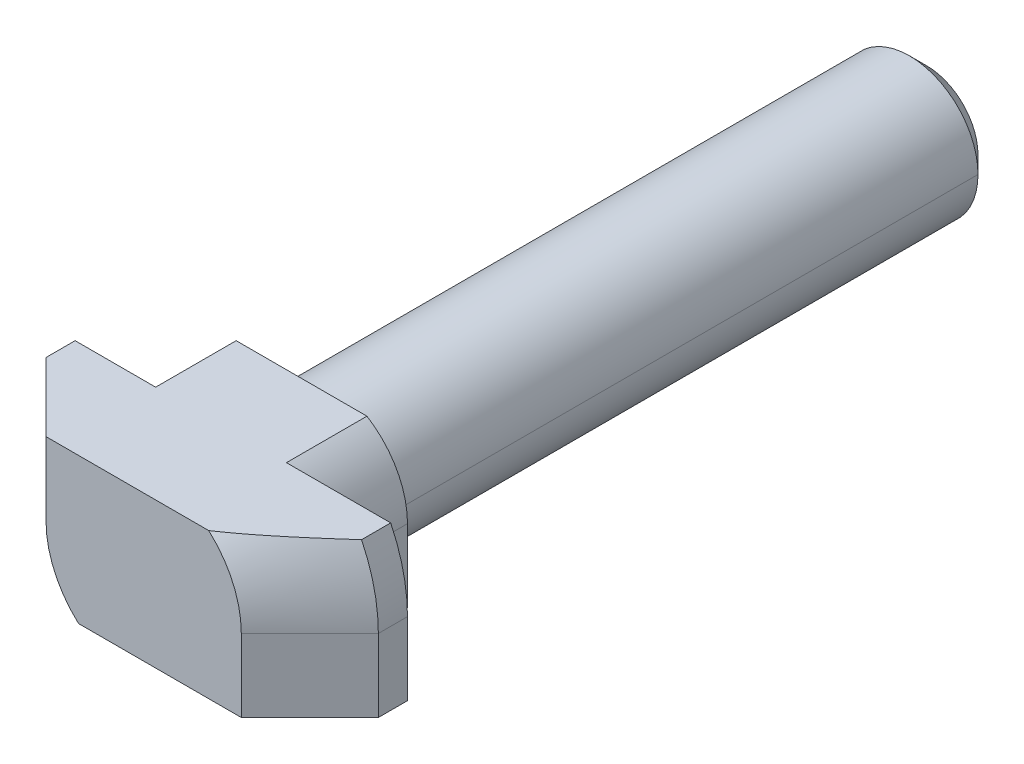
ISO-10303-21;
HEADER;
FILE_DESCRIPTION(('STEP AP214'),'2;1');
FILE_NAME('part.step','',(''),(''),'','','');
FILE_SCHEMA(('AUTOMOTIVE_DESIGN { 1 0 10303 214 1 1 1 1 }'));
ENDSEC;
DATA;
#1=APPLICATION_CONTEXT('core data for automotive mechanical design processes');
#2=APPLICATION_PROTOCOL_DEFINITION('international standard','automotive_design',2000,#1);
#3=PRODUCT_CONTEXT('',#1,'mechanical');
#4=PRODUCT('Part','Part','',(#3));
#5=PRODUCT_RELATED_PRODUCT_CATEGORY('part','',(#4));
#6=PRODUCT_DEFINITION_FORMATION('','',#4);
#7=PRODUCT_DEFINITION_CONTEXT('part definition',#1,'design');
#8=PRODUCT_DEFINITION('design','',#6,#7);
#9=PRODUCT_DEFINITION_SHAPE('','',#8);
#10=(LENGTH_UNIT() NAMED_UNIT(*) SI_UNIT(.MILLI.,.METRE.));
#11=(NAMED_UNIT(*) PLANE_ANGLE_UNIT() SI_UNIT($,.RADIAN.));
#12=(NAMED_UNIT(*) SI_UNIT($,.STERADIAN.) SOLID_ANGLE_UNIT());
#13=UNCERTAINTY_MEASURE_WITH_UNIT(LENGTH_MEASURE(1.E-05),#10,'distance_accuracy_value','');
#14=(GEOMETRIC_REPRESENTATION_CONTEXT(3) GLOBAL_UNCERTAINTY_ASSIGNED_CONTEXT((#13)) GLOBAL_UNIT_ASSIGNED_CONTEXT((#10,
#11,#12)) REPRESENTATION_CONTEXT('',''));
#15=CARTESIAN_POINT('',(0.,0.,0.));
#16=DIRECTION('',(0.,0.,1.));
#17=DIRECTION('',(1.,0.,0.));
#18=AXIS2_PLACEMENT_3D('',#15,#16,#17);
#19=CARTESIAN_POINT('',(0.,0.,-3.5));
#20=DIRECTION('',(0.,0.,-1.));
#21=DIRECTION('',(1.,0.,0.));
#22=AXIS2_PLACEMENT_3D('',#19,#20,#21);
#23=CYLINDRICAL_SURFACE('',#22,4.);
#24=CARTESIAN_POINT('',(0.,0.,-4.7));
#25=DIRECTION('',(0.,0.,1.));
#26=DIRECTION('',(-1.,0.,0.));
#27=AXIS2_PLACEMENT_3D('',#24,#25,#26);
#28=CIRCLE('',#27,4.);
#29=CARTESIAN_POINT('',(-4.,0.,-4.7));
#30=VERTEX_POINT('',#29);
#31=CARTESIAN_POINT('',(4.,0.,-4.7));
#32=VERTEX_POINT('',#31);
#33=EDGE_CURVE('E124',#30,#32,#28,.T.);
#34=ORIENTED_EDGE('',*,*,#33,.F.);
#35=DIRECTION('',(0.,0.,-1.));
#36=VECTOR('',#35,1.);
#37=CARTESIAN_POINT('',(-4.,0.,-4.7));
#38=LINE('',#37,#36);
#39=CARTESIAN_POINT('',(-4.,0.,-39.));
#40=VERTEX_POINT('',#39);
#41=EDGE_CURVE('E10',#30,#40,#38,.T.);
#42=ORIENTED_EDGE('',*,*,#41,.T.);
#43=CARTESIAN_POINT('',(0.,0.,-39.));
#44=DIRECTION('',(0.,0.,-1.));
#45=DIRECTION('',(1.,0.,0.));
#46=AXIS2_PLACEMENT_3D('',#43,#44,#45);
#47=CIRCLE('',#46,4.);
#48=CARTESIAN_POINT('',(4.,0.,-39.));
#49=VERTEX_POINT('',#48);
#50=EDGE_CURVE('E120',#49,#40,#47,.T.);
#51=ORIENTED_EDGE('',*,*,#50,.F.);
#52=DIRECTION('',(0.,0.,1.));
#53=VECTOR('',#52,1.);
#54=CARTESIAN_POINT('',(4.,0.,-39.));
#55=LINE('',#54,#53);
#56=EDGE_CURVE('E25',#49,#32,#55,.T.);
#57=ORIENTED_EDGE('',*,*,#56,.T.);
#58=EDGE_LOOP('',(#34,#42,#51,#57));
#59=FACE_BOUND('',#58,.T.);
#60=ADVANCED_FACE('F15',(#59),#23,.T.);
#61=CARTESIAN_POINT('',(0.,0.,-3.5));
#62=DIRECTION('',(0.,0.,-1.));
#63=DIRECTION('',(1.,0.,0.));
#64=AXIS2_PLACEMENT_3D('',#61,#62,#63);
#65=CYLINDRICAL_SURFACE('',#64,4.);
#66=CARTESIAN_POINT('',(0.,0.,-4.7));
#67=DIRECTION('',(0.,0.,1.));
#68=DIRECTION('',(1.,0.,0.));
#69=AXIS2_PLACEMENT_3D('',#66,#67,#68);
#70=CIRCLE('',#69,4.);
#71=EDGE_CURVE('E132',#32,#30,#70,.T.);
#72=ORIENTED_EDGE('',*,*,#71,.F.);
#73=ORIENTED_EDGE('',*,*,#56,.F.);
#74=CARTESIAN_POINT('',(0.,0.,-39.));
#75=DIRECTION('',(0.,0.,-1.));
#76=DIRECTION('',(-1.,0.,0.));
#77=AXIS2_PLACEMENT_3D('',#74,#75,#76);
#78=CIRCLE('',#77,4.);
#79=EDGE_CURVE('E109',#40,#49,#78,.T.);
#80=ORIENTED_EDGE('',*,*,#79,.F.);
#81=ORIENTED_EDGE('',*,*,#41,.F.);
#82=EDGE_LOOP('',(#72,#73,#80,#81));
#83=FACE_BOUND('',#82,.T.);
#84=ADVANCED_FACE('F708',(#83),#65,.T.);
#85=CARTESIAN_POINT('',(0.,0.,-39.5));
#86=DIRECTION('',(0.,0.,1.));
#87=DIRECTION('',(-1.,0.,0.));
#88=AXIS2_PLACEMENT_3D('',#85,#86,#87);
#89=CONICAL_SURFACE('',#88,3.5,0.785398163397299);
#90=ORIENTED_EDGE('',*,*,#79,.T.);
#91=DIRECTION('',(0.707106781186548,0.,0.707106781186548));
#92=VECTOR('',#91,1.);
#93=CARTESIAN_POINT('',(3.,0.,-40.));
#94=LINE('',#93,#92);
#95=CARTESIAN_POINT('',(3.,0.,-40.));
#96=VERTEX_POINT('',#95);
#97=EDGE_CURVE('E103',#96,#49,#94,.T.);
#98=ORIENTED_EDGE('',*,*,#97,.F.);
#99=CARTESIAN_POINT('',(0.,0.,-40.));
#100=DIRECTION('',(0.,0.,-1.));
#101=DIRECTION('',(-1.,0.,0.));
#102=AXIS2_PLACEMENT_3D('',#99,#100,#101);
#103=CIRCLE('',#102,3.);
#104=CARTESIAN_POINT('',(-3.,0.,-40.));
#105=VERTEX_POINT('',#104);
#106=EDGE_CURVE('E108',#105,#96,#103,.T.);
#107=ORIENTED_EDGE('',*,*,#106,.F.);
#108=DIRECTION('',(0.707106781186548,0.,-0.707106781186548));
#109=VECTOR('',#108,1.);
#110=CARTESIAN_POINT('',(-4.,0.,-39.));
#111=LINE('',#110,#109);
#112=EDGE_CURVE('E113',#40,#105,#111,.T.);
#113=ORIENTED_EDGE('',*,*,#112,.F.);
#114=EDGE_LOOP('',(#90,#98,#107,#113));
#115=FACE_BOUND('',#114,.T.);
#116=ADVANCED_FACE('F105',(#115),#89,.T.);
#117=CARTESIAN_POINT('',(0.,0.,-39.5));
#118=DIRECTION('',(0.,0.,1.));
#119=DIRECTION('',(-1.,0.,0.));
#120=AXIS2_PLACEMENT_3D('',#117,#118,#119);
#121=CONICAL_SURFACE('',#120,3.5,0.785398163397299);
#122=ORIENTED_EDGE('',*,*,#50,.T.);
#123=ORIENTED_EDGE('',*,*,#112,.T.);
#124=CARTESIAN_POINT('',(0.,0.,-40.));
#125=DIRECTION('',(0.,0.,-1.));
#126=DIRECTION('',(1.,0.,0.));
#127=AXIS2_PLACEMENT_3D('',#124,#125,#126);
#128=CIRCLE('',#127,3.);
#129=EDGE_CURVE('E116',#96,#105,#128,.T.);
#130=ORIENTED_EDGE('',*,*,#129,.F.);
#131=ORIENTED_EDGE('',*,*,#97,.T.);
#132=EDGE_LOOP('',(#122,#123,#130,#131));
#133=FACE_BOUND('',#132,.T.);
#134=ADVANCED_FACE('F117',(#133),#121,.T.);
#135=CARTESIAN_POINT('',(0.,0.,-40.));
#136=DIRECTION('',(0.,0.,1.));
#137=DIRECTION('',(1.,0.,0.));
#138=AXIS2_PLACEMENT_3D('',#135,#136,#137);
#139=PLANE('',#138);
#140=ORIENTED_EDGE('',*,*,#106,.T.);
#141=ORIENTED_EDGE('',*,*,#129,.T.);
#142=EDGE_LOOP('',(#140,#141));
#143=FACE_BOUND('',#142,.T.);
#144=ADVANCED_FACE('F122',(#143),#139,.F.);
#145=CARTESIAN_POINT('',(-4.25,-4.25,-4.7));
#146=DIRECTION('',(0.,0.,-1.));
#147=DIRECTION('',(0.,-1.,0.));
#148=AXIS2_PLACEMENT_3D('',#145,#146,#147);
#149=PLANE('',#148);
#150=ORIENTED_EDGE('',*,*,#71,.T.);
#151=ORIENTED_EDGE('',*,*,#33,.T.);
#152=EDGE_LOOP('',(#150,#151));
#153=FACE_BOUND('',#152,.T.);
#154=DIRECTION('',(1.,0.,0.));
#155=VECTOR('',#154,1.);
#156=CARTESIAN_POINT('',(-5.,4.25,-4.7));
#157=LINE('',#156,#155);
#158=CARTESIAN_POINT('',(-5.,4.25,-4.7));
#159=VERTEX_POINT('',#158);
#160=CARTESIAN_POINT('',(2.633913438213,4.25,-4.7));
#161=VERTEX_POINT('',#160);
#162=EDGE_CURVE('E153',#159,#161,#157,.T.);
#163=ORIENTED_EDGE('',*,*,#162,.T.);
#164=CARTESIAN_POINT('',(0.,0.,-4.7));
#165=DIRECTION('',(0.,0.,-1.));
#166=DIRECTION('',(0.52678268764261,0.850000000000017,0.));
#167=AXIS2_PLACEMENT_3D('',#164,#165,#166);
#168=CIRCLE('',#167,5.);
#169=CARTESIAN_POINT('',(5.,0.,-4.7));
#170=VERTEX_POINT('',#169);
#171=EDGE_CURVE('E145',#161,#170,#168,.T.);
#172=ORIENTED_EDGE('',*,*,#171,.T.);
#173=DIRECTION('',(0.,-1.,0.));
#174=VECTOR('',#173,1.);
#175=CARTESIAN_POINT('',(5.,0.,-4.7));
#176=LINE('',#175,#174);
#177=CARTESIAN_POINT('',(5.,-4.25,-4.7));
#178=VERTEX_POINT('',#177);
#179=EDGE_CURVE('E398',#170,#178,#176,.T.);
#180=ORIENTED_EDGE('',*,*,#179,.T.);
#181=DIRECTION('',(-1.,0.,0.));
#182=VECTOR('',#181,1.);
#183=CARTESIAN_POINT('',(5.,-4.25,-4.7));
#184=LINE('',#183,#182);
#185=CARTESIAN_POINT('',(-2.633913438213,-4.25,-4.7));
#186=VERTEX_POINT('',#185);
#187=EDGE_CURVE('E369',#178,#186,#184,.T.);
#188=ORIENTED_EDGE('',*,*,#187,.T.);
#189=CARTESIAN_POINT('',(0.,0.,-4.7));
#190=DIRECTION('',(0.,0.,-1.));
#191=DIRECTION('',(-0.52678268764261,-0.850000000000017,0.));
#192=AXIS2_PLACEMENT_3D('',#189,#190,#191);
#193=CIRCLE('',#192,5.);
#194=CARTESIAN_POINT('',(-5.,0.,-4.7));
#195=VERTEX_POINT('',#194);
#196=EDGE_CURVE('E395',#186,#195,#193,.T.);
#197=ORIENTED_EDGE('',*,*,#196,.T.);
#198=DIRECTION('',(0.,1.,0.));
#199=VECTOR('',#198,1.);
#200=CARTESIAN_POINT('',(-5.,0.,-4.7));
#201=LINE('',#200,#199);
#202=EDGE_CURVE('E156',#195,#159,#201,.T.);
#203=ORIENTED_EDGE('',*,*,#202,.T.);
#204=EDGE_LOOP('',(#163,#172,#180,#188,#197,#203));
#205=FACE_BOUND('',#204,.T.);
#206=ADVANCED_FACE('F392',(#153,#205),#149,.T.);
#207=CARTESIAN_POINT('',(-5.,-4.25,-3.5));
#208=DIRECTION('',(-1.,0.,0.));
#209=DIRECTION('',(0.,0.,1.));
#210=AXIS2_PLACEMENT_3D('',#207,#208,#209);
#211=PLANE('',#210);
#212=ORIENTED_EDGE('',*,*,#202,.F.);
#213=DIRECTION('',(0.,0.,-1.));
#214=VECTOR('',#213,1.);
#215=CARTESIAN_POINT('',(-5.,0.,0.));
#216=LINE('',#215,#214);
#217=CARTESIAN_POINT('',(-5.,0.,0.));
#218=VERTEX_POINT('',#217);
#219=EDGE_CURVE('E333',#218,#195,#216,.T.);
#220=ORIENTED_EDGE('',*,*,#219,.F.);
#221=DIRECTION('',(0.,-1.,0.));
#222=VECTOR('',#221,1.);
#223=CARTESIAN_POINT('',(-5.,4.25,0.));
#224=LINE('',#223,#222);
#225=CARTESIAN_POINT('',(-5.,4.25,0.));
#226=VERTEX_POINT('',#225);
#227=EDGE_CURVE('E335',#226,#218,#224,.T.);
#228=ORIENTED_EDGE('',*,*,#227,.F.);
#229=DIRECTION('',(0.,0.,1.));
#230=VECTOR('',#229,1.);
#231=CARTESIAN_POINT('',(-5.,4.25,-4.7));
#232=LINE('',#231,#230);
#233=EDGE_CURVE('E150',#159,#226,#232,.T.);
#234=ORIENTED_EDGE('',*,*,#233,.F.);
#235=EDGE_LOOP('',(#212,#220,#228,#234));
#236=FACE_BOUND('',#235,.T.);
#237=ADVANCED_FACE('F203',(#236),#211,.T.);
#238=CARTESIAN_POINT('',(0.,4.25,0.));
#239=DIRECTION('',(0.,1.,0.));
#240=DIRECTION('',(1.,0.,0.));
#241=AXIS2_PLACEMENT_3D('',#238,#239,#240);
#242=PLANE('',#241);
#243=ORIENTED_EDGE('',*,*,#233,.T.);
#244=DIRECTION('',(1.,0.,0.));
#245=VECTOR('',#244,1.);
#246=CARTESIAN_POINT('',(-9.7,4.25,0.));
#247=LINE('',#246,#245);
#248=CARTESIAN_POINT('',(-9.7,4.25,0.));
#249=VERTEX_POINT('',#248);
#250=EDGE_CURVE('E338',#249,#226,#247,.T.);
#251=ORIENTED_EDGE('',*,*,#250,.F.);
#252=DIRECTION('',(0.,0.,1.));
#253=VECTOR('',#252,1.);
#254=CARTESIAN_POINT('',(-9.7,4.25,0.));
#255=LINE('',#254,#253);
#256=CARTESIAN_POINT('',(-9.7,4.25,1.7));
#257=VERTEX_POINT('',#256);
#258=EDGE_CURVE('E363',#249,#257,#255,.T.);
#259=ORIENTED_EDGE('',*,*,#258,.T.);
#260=DIRECTION('',(0.707106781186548,0.,0.707106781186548));
#261=VECTOR('',#260,1.);
#262=CARTESIAN_POINT('',(-9.7,4.25,1.7));
#263=LINE('',#262,#261);
#264=CARTESIAN_POINT('',(-5.7,4.25,5.7));
#265=VERTEX_POINT('',#264);
#266=EDGE_CURVE('E364',#257,#265,#263,.T.);
#267=ORIENTED_EDGE('',*,*,#266,.T.);
#268=DIRECTION('',(-1.,0.,0.));
#269=VECTOR('',#268,1.);
#270=CARTESIAN_POINT('',(3.798354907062,4.25,5.7));
#271=LINE('',#270,#269);
#272=CARTESIAN_POINT('',(3.798354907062,4.25,5.7));
#273=VERTEX_POINT('',#272);
#274=EDGE_CURVE('E227',#273,#265,#271,.T.);
#275=ORIENTED_EDGE('',*,*,#274,.F.);
#276=CARTESIAN_POINT('',(8.7193749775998,4.24999999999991,1.69999999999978));
#277=CARTESIAN_POINT('',(8.53058273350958,4.25001419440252,1.86968163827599));
#278=CARTESIAN_POINT('',(8.34127899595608,4.25003403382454,2.03879804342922));
#279=CARTESIAN_POINT('',(7.97138467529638,4.25005726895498,2.36678605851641));
#280=CARTESIAN_POINT('',(7.79085794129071,4.25006147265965,2.52572971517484));
#281=CARTESIAN_POINT('',(7.43848817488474,4.25003341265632,2.83338237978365));
#282=CARTESIAN_POINT('',(7.26671572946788,4.25000314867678,2.98217212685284));
#283=CARTESIAN_POINT('',(6.94334111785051,4.2499974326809,3.25957911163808));
#284=CARTESIAN_POINT('',(6.79190540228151,4.25001559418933,3.38839023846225));
#285=CARTESIAN_POINT('',(6.49504307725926,4.25003494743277,3.638409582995));
#286=CARTESIAN_POINT('',(6.34967488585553,4.25003690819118,3.75968710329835));
#287=CARTESIAN_POINT('',(6.06489527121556,4.25001092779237,3.99463746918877));
#288=CARTESIAN_POINT('',(5.92554808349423,4.24998447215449,4.10838806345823));
#289=CARTESIAN_POINT('',(5.66692445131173,4.25001084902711,4.31680146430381));
#290=CARTESIAN_POINT('',(5.54784981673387,4.25005213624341,4.4117144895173));
#291=CARTESIAN_POINT('',(5.31321575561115,4.25015511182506,4.59639440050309));
#292=CARTESIAN_POINT('',(5.19770062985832,4.25021594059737,4.68621751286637));
#293=CARTESIAN_POINT('',(4.97014137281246,4.25029767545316,4.86071741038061));
#294=CARTESIAN_POINT('',(4.85814458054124,4.25032008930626,4.9454558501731));
#295=CARTESIAN_POINT('',(4.63755351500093,4.25031460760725,5.10977806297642));
#296=CARTESIAN_POINT('',(4.52901012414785,4.25028875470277,5.18943006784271));
#297=CARTESIAN_POINT('',(4.31523903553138,4.25020209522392,5.34357849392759));
#298=CARTESIAN_POINT('',(4.2100658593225,4.25014281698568,5.41815032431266));
#299=CARTESIAN_POINT('',(4.00291262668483,4.25004558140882,5.56211180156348));
#300=CARTESIAN_POINT('',(3.90099131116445,4.25000681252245,5.63158606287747));
#301=CARTESIAN_POINT('',(3.79835490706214,4.25000000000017,5.70000000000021));
#302=B_SPLINE_CURVE_WITH_KNOTS('',3,(#276,#277,#278,#279,#280,#281,#282,#283,#284,#285,#286,
#287,#288,#289,#290,#291,#292,#293,#294,#295,#296,#297,#298,#299,#300,#301),.UNSPECIFIED.,.F.,
.F.,(4,2,2,2,2,2,2,2,2,2,2,2,4),(0.,0.761520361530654,1.48309358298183,2.16484525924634,
2.76126462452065,3.3292000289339,3.86882803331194,4.32563892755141,4.76461195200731,
5.18592348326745,5.58980789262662,5.97656952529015,6.34659649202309),.UNSPECIFIED.);
#303=CARTESIAN_POINT('',(8.7193749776,4.25,1.7));
#304=VERTEX_POINT('',#303);
#305=EDGE_CURVE('E174',#304,#273,#302,.T.);
#306=ORIENTED_EDGE('',*,*,#305,.F.);
#307=DIRECTION('',(0.,0.,1.));
#308=VECTOR('',#307,1.);
#309=CARTESIAN_POINT('',(8.7193749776,4.25,0.));
#310=LINE('',#309,#308);
#311=CARTESIAN_POINT('',(8.7193749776,4.25,0.));
#312=VERTEX_POINT('',#311);
#313=EDGE_CURVE('E218',#312,#304,#310,.T.);
#314=ORIENTED_EDGE('',*,*,#313,.F.);
#315=DIRECTION('',(-1.,0.,0.));
#316=VECTOR('',#315,1.);
#317=CARTESIAN_POINT('',(8.7193749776,4.25,0.));
#318=LINE('',#317,#316);
#319=CARTESIAN_POINT('',(2.633913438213,4.25,0.));
#320=VERTEX_POINT('',#319);
#321=EDGE_CURVE('E141',#312,#320,#318,.T.);
#322=ORIENTED_EDGE('',*,*,#321,.T.);
#323=DIRECTION('',(0.,0.,1.));
#324=VECTOR('',#323,1.);
#325=CARTESIAN_POINT('',(2.633913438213,4.25,-4.7));
#326=LINE('',#325,#324);
#327=EDGE_CURVE('E149',#161,#320,#326,.T.);
#328=ORIENTED_EDGE('',*,*,#327,.F.);
#329=ORIENTED_EDGE('',*,*,#162,.F.);
#330=EDGE_LOOP('',(#243,#251,#259,#267,#275,#306,#314,#322,#328,#329));
#331=FACE_BOUND('',#330,.T.);
#332=ADVANCED_FACE('F198',(#331),#242,.T.);
#333=CARTESIAN_POINT('',(0.,0.,-3.96));
#334=DIRECTION('',(0.,0.,1.));
#335=DIRECTION('',(-1.,0.,0.));
#336=AXIS2_PLACEMENT_3D('',#333,#334,#335);
#337=CYLINDRICAL_SURFACE('',#336,5.);
#338=DIRECTION('',(0.,0.,-1.));
#339=VECTOR('',#338,1.);
#340=CARTESIAN_POINT('',(5.,0.,0.));
#341=LINE('',#340,#339);
#342=CARTESIAN_POINT('',(5.,0.,0.));
#343=VERTEX_POINT('',#342);
#344=EDGE_CURVE('E428',#343,#170,#341,.T.);
#345=ORIENTED_EDGE('',*,*,#344,.T.);
#346=ORIENTED_EDGE('',*,*,#171,.F.);
#347=ORIENTED_EDGE('',*,*,#327,.T.);
#348=CARTESIAN_POINT('',(0.,0.,0.));
#349=DIRECTION('',(0.,0.,1.));
#350=DIRECTION('',(1.,0.,0.));
#351=AXIS2_PLACEMENT_3D('',#348,#349,#350);
#352=CIRCLE('',#351,5.);
#353=EDGE_CURVE('E140',#343,#320,#352,.T.);
#354=ORIENTED_EDGE('',*,*,#353,.F.);
#355=EDGE_LOOP('',(#345,#346,#347,#354));
#356=FACE_BOUND('',#355,.T.);
#357=ADVANCED_FACE('F202',(#356),#337,.T.);
#358=CARTESIAN_POINT('',(9.7,-4.25,0.));
#359=DIRECTION('',(0.,0.,-1.));
#360=DIRECTION('',(0.,-1.,0.));
#361=AXIS2_PLACEMENT_3D('',#358,#359,#360);
#362=PLANE('',#361);
#363=DIRECTION('',(-1.,0.,0.));
#364=VECTOR('',#363,1.);
#365=CARTESIAN_POINT('',(9.7,-4.25,0.));
#366=LINE('',#365,#364);
#367=CARTESIAN_POINT('',(9.7,-4.25,0.));
#368=VERTEX_POINT('',#367);
#369=CARTESIAN_POINT('',(5.,-4.25,0.));
#370=VERTEX_POINT('',#369);
#371=EDGE_CURVE('E365',#368,#370,#366,.T.);
#372=ORIENTED_EDGE('',*,*,#371,.T.);
#373=DIRECTION('',(0.,-1.,0.));
#374=VECTOR('',#373,1.);
#375=CARTESIAN_POINT('',(5.,0.,0.));
#376=LINE('',#375,#374);
#377=EDGE_CURVE('E424',#343,#370,#376,.T.);
#378=ORIENTED_EDGE('',*,*,#377,.F.);
#379=ORIENTED_EDGE('',*,*,#353,.T.);
#380=ORIENTED_EDGE('',*,*,#321,.F.);
#381=CARTESIAN_POINT('',(0.,0.,0.));
#382=DIRECTION('',(0.,0.,-1.));
#383=DIRECTION('',(0.898904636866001,0.4381443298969,0.));
#384=AXIS2_PLACEMENT_3D('',#381,#382,#383);
#385=CIRCLE('',#384,9.7);
#386=CARTESIAN_POINT('',(9.7,1.969450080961E-13,0.));
#387=VERTEX_POINT('',#386);
#388=EDGE_CURVE('E224',#312,#387,#385,.T.);
#389=ORIENTED_EDGE('',*,*,#388,.T.);
#390=DIRECTION('',(0.,-1.,0.));
#391=VECTOR('',#390,1.);
#392=CARTESIAN_POINT('',(9.7,1.969450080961E-13,0.));
#393=LINE('',#392,#391);
#394=EDGE_CURVE('E138',#387,#368,#393,.T.);
#395=ORIENTED_EDGE('',*,*,#394,.T.);
#396=EDGE_LOOP('',(#372,#378,#379,#380,#389,#395));
#397=FACE_BOUND('',#396,.T.);
#398=ADVANCED_FACE('F578',(#397),#362,.T.);
#399=CARTESIAN_POINT('',(9.7,-4.25,1.7));
#400=DIRECTION('',(1.,0.,0.));
#401=DIRECTION('',(0.,1.,0.));
#402=AXIS2_PLACEMENT_3D('',#399,#400,#401);
#403=PLANE('',#402);
#404=ORIENTED_EDGE('',*,*,#394,.F.);
#405=DIRECTION('',(0.,0.,-1.));
#406=VECTOR('',#405,1.);
#407=CARTESIAN_POINT('',(9.7,0.,1.7));
#408=LINE('',#407,#406);
#409=CARTESIAN_POINT('',(9.7,0.,1.7));
#410=VERTEX_POINT('',#409);
#411=EDGE_CURVE('E217',#410,#387,#408,.T.);
#412=ORIENTED_EDGE('',*,*,#411,.F.);
#413=DIRECTION('',(0.,1.,0.));
#414=VECTOR('',#413,1.);
#415=CARTESIAN_POINT('',(9.7,-4.25,1.7));
#416=LINE('',#415,#414);
#417=CARTESIAN_POINT('',(9.7,-4.25,1.7));
#418=VERTEX_POINT('',#417);
#419=EDGE_CURVE('E345',#418,#410,#416,.T.);
#420=ORIENTED_EDGE('',*,*,#419,.F.);
#421=DIRECTION('',(0.,0.,-1.));
#422=VECTOR('',#421,1.);
#423=CARTESIAN_POINT('',(9.7,-4.25,1.7));
#424=LINE('',#423,#422);
#425=EDGE_CURVE('E136',#418,#368,#424,.T.);
#426=ORIENTED_EDGE('',*,*,#425,.T.);
#427=EDGE_LOOP('',(#404,#412,#420,#426));
#428=FACE_BOUND('',#427,.T.);
#429=ADVANCED_FACE('F276',(#428),#403,.T.);
#430=CARTESIAN_POINT('',(0.,-4.25,0.));
#431=DIRECTION('',(0.,1.,0.));
#432=DIRECTION('',(1.,0.,0.));
#433=AXIS2_PLACEMENT_3D('',#430,#431,#432);
#434=PLANE('',#433);
#435=DIRECTION('',(0.,0.,1.));
#436=VECTOR('',#435,1.);
#437=CARTESIAN_POINT('',(-2.633913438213,-4.25,-4.7));
#438=LINE('',#437,#436);
#439=CARTESIAN_POINT('',(-2.633913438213,-4.25,0.));
#440=VERTEX_POINT('',#439);
#441=EDGE_CURVE('E406',#186,#440,#438,.T.);
#442=ORIENTED_EDGE('',*,*,#441,.F.);
#443=ORIENTED_EDGE('',*,*,#187,.F.);
#444=DIRECTION('',(0.,0.,-1.));
#445=VECTOR('',#444,1.);
#446=CARTESIAN_POINT('',(5.,-4.25,0.));
#447=LINE('',#446,#445);
#448=EDGE_CURVE('E419',#370,#178,#447,.T.);
#449=ORIENTED_EDGE('',*,*,#448,.F.);
#450=ORIENTED_EDGE('',*,*,#371,.F.);
#451=ORIENTED_EDGE('',*,*,#425,.F.);
#452=DIRECTION('',(-0.707106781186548,0.,0.707106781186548));
#453=VECTOR('',#452,1.);
#454=CARTESIAN_POINT('',(9.7,-4.25,1.7));
#455=LINE('',#454,#453);
#456=CARTESIAN_POINT('',(5.7,-4.25,5.7));
#457=VERTEX_POINT('',#456);
#458=EDGE_CURVE('E355',#418,#457,#455,.T.);
#459=ORIENTED_EDGE('',*,*,#458,.T.);
#460=DIRECTION('',(1.,0.,0.));
#461=VECTOR('',#460,1.);
#462=CARTESIAN_POINT('',(-3.798354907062,-4.25,5.7));
#463=LINE('',#462,#461);
#464=CARTESIAN_POINT('',(-3.798354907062,-4.25,5.7));
#465=VERTEX_POINT('',#464);
#466=EDGE_CURVE('E232',#465,#457,#463,.T.);
#467=ORIENTED_EDGE('',*,*,#466,.F.);
#468=CARTESIAN_POINT('',(-8.71937497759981,-4.24999999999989,1.69999999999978));
#469=CARTESIAN_POINT('',(-8.53058273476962,-4.25001419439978,1.86968163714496));
#470=CARTESIAN_POINT('',(-8.34127899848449,-4.25003403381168,2.03879804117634));
#471=CARTESIAN_POINT('',(-7.97138468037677,-4.25005726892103,2.36678605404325));
#472=CARTESIAN_POINT('',(-7.79085794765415,-4.25006147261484,2.52572970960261));
#473=CARTESIAN_POINT('',(-7.43848818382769,-4.25003341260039,2.83338237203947));
#474=CARTESIAN_POINT('',(-7.26671573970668,-4.25000314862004,2.98217211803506));
#475=CARTESIAN_POINT('',(-6.94334112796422,-4.24999743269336,3.25957910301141));
#476=CARTESIAN_POINT('',(-6.79190541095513,-4.25001559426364,3.38839023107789));
#477=CARTESIAN_POINT('',(-6.49504308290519,-4.25003494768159,3.63840957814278));
#478=CARTESIAN_POINT('',(-6.34967488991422,-4.25003690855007,3.7596870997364));
#479=CARTESIAN_POINT('',(-6.06489527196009,-4.2500109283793,3.99463746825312));
#480=CARTESIAN_POINT('',(-5.92554808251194,-4.24998447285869,4.10838806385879));
#481=CARTESIAN_POINT('',(-5.66692444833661,-4.25001084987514,4.31680146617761));
#482=CARTESIAN_POINT('',(-5.54784981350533,-4.25005213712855,4.41171449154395));
#483=CARTESIAN_POINT('',(-5.3132157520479,-4.25015511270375,4.59639440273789));
#484=CARTESIAN_POINT('',(-5.19770062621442,-4.25021594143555,4.68621751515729));
#485=CARTESIAN_POINT('',(-4.97014136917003,-4.25029767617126,4.86071741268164));
#486=CARTESIAN_POINT('',(-4.85814457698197,-4.25032008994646,4.94545585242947));
#487=CARTESIAN_POINT('',(-4.6375535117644,-4.2503146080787,5.10977806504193));
#488=CARTESIAN_POINT('',(-4.52901012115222,-4.2502887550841,5.18943006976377));
#489=CARTESIAN_POINT('',(-4.31523903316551,-4.25020209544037,5.34357849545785));
#490=CARTESIAN_POINT('',(-4.21006585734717,-4.25014281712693,5.41815032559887));
#491=CARTESIAN_POINT('',(-4.00291262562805,-4.25004558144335,5.56211180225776));
#492=CARTESIAN_POINT('',(-3.90099131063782,-4.25000681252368,5.63158606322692));
#493=CARTESIAN_POINT('',(-3.79835490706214,-4.25000000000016,5.70000000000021));
#494=B_SPLINE_CURVE_WITH_KNOTS('',3,(#468,#469,#470,#471,#472,#473,#474,#475,#476,#477,#478,
#479,#480,#481,#482,#483,#484,#485,#486,#487,#488,#489,#490,#491,#492,#493),.UNSPECIFIED.,.F.,
.F.,(4,2,2,2,2,2,2,2,2,2,2,2,4),(0.,0.761520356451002,1.4830935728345,2.16484524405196,
2.76126461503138,3.32920002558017,3.86882803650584,4.32563893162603,4.76461195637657,
5.18592348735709,5.58980789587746,5.97656952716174,6.346596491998),.UNSPECIFIED.);
#495=CARTESIAN_POINT('',(-8.7193749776,-4.25,1.7));
#496=VERTEX_POINT('',#495);
#497=EDGE_CURVE('E248',#496,#465,#494,.T.);
#498=ORIENTED_EDGE('',*,*,#497,.F.);
#499=DIRECTION('',(0.,0.,1.));
#500=VECTOR('',#499,1.);
#501=CARTESIAN_POINT('',(-8.7193749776,-4.25,0.));
#502=LINE('',#501,#500);
#503=CARTESIAN_POINT('',(-8.7193749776,-4.25,0.));
#504=VERTEX_POINT('',#503);
#505=EDGE_CURVE('E290',#504,#496,#502,.T.);
#506=ORIENTED_EDGE('',*,*,#505,.F.);
#507=DIRECTION('',(-1.,0.,0.));
#508=VECTOR('',#507,1.);
#509=CARTESIAN_POINT('',(-2.633913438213,-4.25,0.));
#510=LINE('',#509,#508);
#511=EDGE_CURVE('E337',#440,#504,#510,.T.);
#512=ORIENTED_EDGE('',*,*,#511,.F.);
#513=EDGE_LOOP('',(#442,#443,#449,#450,#451,#459,#467,#498,#506,#512));
#514=FACE_BOUND('',#513,.T.);
#515=ADVANCED_FACE('F272',(#514),#434,.F.);
#516=CARTESIAN_POINT('',(-5.,-4.25,0.));
#517=DIRECTION('',(0.,0.,-1.));
#518=DIRECTION('',(0.,-1.,0.));
#519=AXIS2_PLACEMENT_3D('',#516,#517,#518);
#520=PLANE('',#519);
#521=ORIENTED_EDGE('',*,*,#250,.T.);
#522=ORIENTED_EDGE('',*,*,#227,.T.);
#523=CARTESIAN_POINT('',(0.,0.,0.));
#524=DIRECTION('',(0.,0.,1.));
#525=DIRECTION('',(-1.,0.,0.));
#526=AXIS2_PLACEMENT_3D('',#523,#524,#525);
#527=CIRCLE('',#526,5.);
#528=EDGE_CURVE('E413',#218,#440,#527,.T.);
#529=ORIENTED_EDGE('',*,*,#528,.T.);
#530=ORIENTED_EDGE('',*,*,#511,.T.);
#531=CARTESIAN_POINT('',(0.,0.,0.));
#532=DIRECTION('',(0.,0.,-1.));
#533=DIRECTION('',(-0.898904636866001,-0.4381443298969,0.));
#534=AXIS2_PLACEMENT_3D('',#531,#532,#533);
#535=CIRCLE('',#534,9.7);
#536=CARTESIAN_POINT('',(-9.7,-1.535191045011E-13,0.));
#537=VERTEX_POINT('',#536);
#538=EDGE_CURVE('E296',#504,#537,#535,.T.);
#539=ORIENTED_EDGE('',*,*,#538,.T.);
#540=DIRECTION('',(0.,1.,0.));
#541=VECTOR('',#540,1.);
#542=CARTESIAN_POINT('',(-9.7,-1.535191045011E-13,0.));
#543=LINE('',#542,#541);
#544=EDGE_CURVE('E359',#537,#249,#543,.T.);
#545=ORIENTED_EDGE('',*,*,#544,.T.);
#546=EDGE_LOOP('',(#521,#522,#529,#530,#539,#545));
#547=FACE_BOUND('',#546,.T.);
#548=ADVANCED_FACE('F275',(#547),#520,.T.);
#549=CARTESIAN_POINT('',(-9.7,-4.25,0.));
#550=DIRECTION('',(-1.,0.,0.));
#551=DIRECTION('',(0.,0.,1.));
#552=AXIS2_PLACEMENT_3D('',#549,#550,#551);
#553=PLANE('',#552);
#554=ORIENTED_EDGE('',*,*,#544,.F.);
#555=DIRECTION('',(0.,0.,-1.));
#556=VECTOR('',#555,1.);
#557=CARTESIAN_POINT('',(-9.7,0.,1.7));
#558=LINE('',#557,#556);
#559=CARTESIAN_POINT('',(-9.7,0.,1.7));
#560=VERTEX_POINT('',#559);
#561=EDGE_CURVE('E289',#560,#537,#558,.T.);
#562=ORIENTED_EDGE('',*,*,#561,.F.);
#563=DIRECTION('',(0.,-1.,0.));
#564=VECTOR('',#563,1.);
#565=CARTESIAN_POINT('',(-9.7,4.25,1.7));
#566=LINE('',#565,#564);
#567=EDGE_CURVE('E372',#257,#560,#566,.T.);
#568=ORIENTED_EDGE('',*,*,#567,.F.);
#569=ORIENTED_EDGE('',*,*,#258,.F.);
#570=EDGE_LOOP('',(#554,#562,#568,#569));
#571=FACE_BOUND('',#570,.T.);
#572=ADVANCED_FACE('F196',(#571),#553,.T.);
#573=CARTESIAN_POINT('',(-9.7,-4.25,1.7));
#574=DIRECTION('',(-0.707106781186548,0.,0.707106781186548));
#575=DIRECTION('',(0.,1.,0.));
#576=AXIS2_PLACEMENT_3D('',#573,#574,#575);
#577=PLANE('',#576);
#578=ORIENTED_EDGE('',*,*,#567,.T.);
#579=DIRECTION('',(-0.707106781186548,0.,-0.707106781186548));
#580=VECTOR('',#579,1.);
#581=CARTESIAN_POINT('',(-5.7,-2.437241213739E-13,5.7));
#582=LINE('',#581,#580);
#583=CARTESIAN_POINT('',(-5.7,-2.433608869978E-13,5.7));
#584=VERTEX_POINT('',#583);
#585=EDGE_CURVE('E305',#584,#560,#582,.T.);
#586=ORIENTED_EDGE('',*,*,#585,.F.);
#587=DIRECTION('',(0.,-1.,0.));
#588=VECTOR('',#587,1.);
#589=CARTESIAN_POINT('',(-5.7,4.25,5.7));
#590=LINE('',#589,#588);
#591=EDGE_CURVE('E231',#265,#584,#590,.T.);
#592=ORIENTED_EDGE('',*,*,#591,.F.);
#593=ORIENTED_EDGE('',*,*,#266,.F.);
#594=EDGE_LOOP('',(#578,#586,#592,#593));
#595=FACE_BOUND('',#594,.T.);
#596=ADVANCED_FACE('F193',(#595),#577,.T.);
#597=CARTESIAN_POINT('',(-5.7,-4.25,5.7));
#598=DIRECTION('',(0.,0.,1.));
#599=DIRECTION('',(1.,0.,0.));
#600=AXIS2_PLACEMENT_3D('',#597,#598,#599);
#601=PLANE('',#600);
#602=CARTESIAN_POINT('',(0.,0.,5.7));
#603=DIRECTION('',(0.,0.,1.));
#604=DIRECTION('',(-1.,-1.27047685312E-13,0.));
#605=AXIS2_PLACEMENT_3D('',#602,#603,#604);
#606=CIRCLE('',#605,5.7);
#607=EDGE_CURVE('E302',#584,#465,#606,.T.);
#608=ORIENTED_EDGE('',*,*,#607,.T.);
#609=ORIENTED_EDGE('',*,*,#466,.T.);
#610=DIRECTION('',(0.,1.,0.));
#611=VECTOR('',#610,1.);
#612=CARTESIAN_POINT('',(5.7,-4.25,5.7));
#613=LINE('',#612,#611);
#614=CARTESIAN_POINT('',(5.7,7.602807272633E-13,5.7));
#615=VERTEX_POINT('',#614);
#616=EDGE_CURVE('E344',#457,#615,#613,.T.);
#617=ORIENTED_EDGE('',*,*,#616,.T.);
#618=CARTESIAN_POINT('',(0.,0.,5.7));
#619=DIRECTION('',(0.,0.,1.));
#620=DIRECTION('',(1.,1.319264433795E-13,0.));
#621=AXIS2_PLACEMENT_3D('',#618,#619,#620);
#622=CIRCLE('',#621,5.7);
#623=EDGE_CURVE('E235',#615,#273,#622,.T.);
#624=ORIENTED_EDGE('',*,*,#623,.T.);
#625=ORIENTED_EDGE('',*,*,#274,.T.);
#626=ORIENTED_EDGE('',*,*,#591,.T.);
#627=EDGE_LOOP('',(#608,#609,#617,#624,#625,#626));
#628=FACE_BOUND('',#627,.T.);
#629=ADVANCED_FACE('F191',(#628),#601,.T.);
#630=CARTESIAN_POINT('',(0.,0.,3.7));
#631=DIRECTION('',(0.,0.,-1.));
#632=DIRECTION('',(-1.,0.,0.));
#633=AXIS2_PLACEMENT_3D('',#630,#631,#632);
#634=CONICAL_SURFACE('',#633,7.7,0.785398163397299);
#635=CARTESIAN_POINT('',(0.,0.,1.7));
#636=DIRECTION('',(0.,0.,1.));
#637=DIRECTION('',(1.,0.,0.));
#638=AXIS2_PLACEMENT_3D('',#635,#636,#637);
#639=CIRCLE('',#638,9.7);
#640=EDGE_CURVE('E209',#410,#304,#639,.T.);
#641=ORIENTED_EDGE('',*,*,#640,.T.);
#642=ORIENTED_EDGE('',*,*,#305,.T.);
#643=ORIENTED_EDGE('',*,*,#623,.F.);
#644=DIRECTION('',(0.707106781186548,0.,-0.707106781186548));
#645=VECTOR('',#644,1.);
#646=CARTESIAN_POINT('',(5.7,2.715104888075E-13,5.7));
#647=LINE('',#646,#645);
#648=EDGE_CURVE('E340',#615,#410,#647,.T.);
#649=ORIENTED_EDGE('',*,*,#648,.T.);
#650=EDGE_LOOP('',(#641,#642,#643,#649));
#651=FACE_BOUND('',#650,.T.);
#652=ADVANCED_FACE('F180',(#651),#634,.T.);
#653=CARTESIAN_POINT('',(5.7,-4.25,5.7));
#654=DIRECTION('',(0.707106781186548,0.,0.707106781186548));
#655=DIRECTION('',(0.,-1.,0.));
#656=AXIS2_PLACEMENT_3D('',#653,#654,#655);
#657=PLANE('',#656);
#658=ORIENTED_EDGE('',*,*,#419,.T.);
#659=ORIENTED_EDGE('',*,*,#648,.F.);
#660=ORIENTED_EDGE('',*,*,#616,.F.);
#661=ORIENTED_EDGE('',*,*,#458,.F.);
#662=EDGE_LOOP('',(#658,#659,#660,#661));
#663=FACE_BOUND('',#662,.T.);
#664=ADVANCED_FACE('F190',(#663),#657,.T.);
#665=CARTESIAN_POINT('',(0.,0.,-3.96));
#666=DIRECTION('',(0.,0.,1.));
#667=DIRECTION('',(-1.,0.,0.));
#668=AXIS2_PLACEMENT_3D('',#665,#666,#667);
#669=CYLINDRICAL_SURFACE('',#668,9.7);
#670=ORIENTED_EDGE('',*,*,#388,.F.);
#671=ORIENTED_EDGE('',*,*,#313,.T.);
#672=ORIENTED_EDGE('',*,*,#640,.F.);
#673=ORIENTED_EDGE('',*,*,#411,.T.);
#674=EDGE_LOOP('',(#670,#671,#672,#673));
#675=FACE_BOUND('',#674,.T.);
#676=ADVANCED_FACE('F265',(#675),#669,.T.);
#677=CARTESIAN_POINT('',(0.,0.,3.7));
#678=DIRECTION('',(0.,0.,-1.));
#679=DIRECTION('',(-1.,0.,0.));
#680=AXIS2_PLACEMENT_3D('',#677,#678,#679);
#681=CONICAL_SURFACE('',#680,7.7,0.785398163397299);
#682=CARTESIAN_POINT('',(0.,0.,1.7));
#683=DIRECTION('',(0.,0.,1.));
#684=DIRECTION('',(-1.,0.,0.));
#685=AXIS2_PLACEMENT_3D('',#682,#683,#684);
#686=CIRCLE('',#685,9.7);
#687=EDGE_CURVE('E281',#560,#496,#686,.T.);
#688=ORIENTED_EDGE('',*,*,#687,.T.);
#689=ORIENTED_EDGE('',*,*,#497,.T.);
#690=ORIENTED_EDGE('',*,*,#607,.F.);
#691=ORIENTED_EDGE('',*,*,#585,.T.);
#692=EDGE_LOOP('',(#688,#689,#690,#691));
#693=FACE_BOUND('',#692,.T.);
#694=ADVANCED_FACE('F254',(#693),#681,.T.);
#695=CARTESIAN_POINT('',(0.,0.,-3.96));
#696=DIRECTION('',(0.,0.,1.));
#697=DIRECTION('',(-1.,0.,0.));
#698=AXIS2_PLACEMENT_3D('',#695,#696,#697);
#699=CYLINDRICAL_SURFACE('',#698,9.7);
#700=ORIENTED_EDGE('',*,*,#538,.F.);
#701=ORIENTED_EDGE('',*,*,#505,.T.);
#702=ORIENTED_EDGE('',*,*,#687,.F.);
#703=ORIENTED_EDGE('',*,*,#561,.T.);
#704=EDGE_LOOP('',(#700,#701,#702,#703));
#705=FACE_BOUND('',#704,.T.);
#706=ADVANCED_FACE('F264',(#705),#699,.T.);
#707=CARTESIAN_POINT('',(0.,0.,-3.96));
#708=DIRECTION('',(0.,0.,1.));
#709=DIRECTION('',(-1.,0.,0.));
#710=AXIS2_PLACEMENT_3D('',#707,#708,#709);
#711=CYLINDRICAL_SURFACE('',#710,5.);
#712=ORIENTED_EDGE('',*,*,#196,.F.);
#713=ORIENTED_EDGE('',*,*,#441,.T.);
#714=ORIENTED_EDGE('',*,*,#528,.F.);
#715=ORIENTED_EDGE('',*,*,#219,.T.);
#716=EDGE_LOOP('',(#712,#713,#714,#715));
#717=FACE_BOUND('',#716,.T.);
#718=ADVANCED_FACE('F416',(#717),#711,.T.);
#719=CARTESIAN_POINT('',(5.,-4.25,0.));
#720=DIRECTION('',(1.,0.,0.));
#721=DIRECTION('',(0.,1.,0.));
#722=AXIS2_PLACEMENT_3D('',#719,#720,#721);
#723=PLANE('',#722);
#724=ORIENTED_EDGE('',*,*,#179,.F.);
#725=ORIENTED_EDGE('',*,*,#344,.F.);
#726=ORIENTED_EDGE('',*,*,#377,.T.);
#727=ORIENTED_EDGE('',*,*,#448,.T.);
#728=EDGE_LOOP('',(#724,#725,#726,#727));
#729=FACE_BOUND('',#728,.T.);
#730=ADVANCED_FACE('F591',(#729),#723,.T.);
#731=CLOSED_SHELL('',(#60,#84,#116,#134,#144,#206,#237,#332,#357,#398,#429,#515,#548,#572,#596,
#629,#652,#664,#676,#694,#706,#718,#730));
#732=MANIFOLD_SOLID_BREP('B1',#731);
#733=ADVANCED_BREP_SHAPE_REPRESENTATION('',(#18,#732),#14);
#734=SHAPE_DEFINITION_REPRESENTATION(#9,#733);
ENDSEC;
END-ISO-10303-21;
